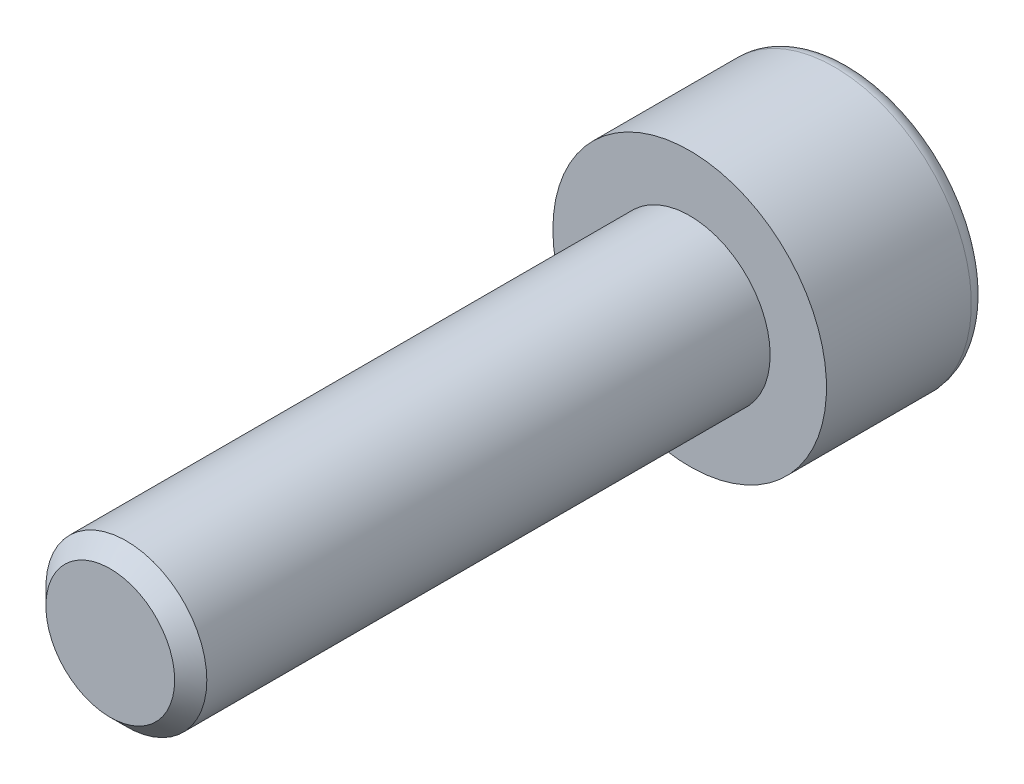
ISO-10303-21;
HEADER;
FILE_DESCRIPTION(('STEP AP214'),'2;1');
FILE_NAME('part.step','',(''),(''),'','','');
FILE_SCHEMA(('AUTOMOTIVE_DESIGN { 1 0 10303 214 1 1 1 1 }'));
ENDSEC;
DATA;
#1=APPLICATION_CONTEXT('core data for automotive mechanical design processes');
#2=APPLICATION_PROTOCOL_DEFINITION('international standard','automotive_design',2000,#1);
#3=PRODUCT_CONTEXT('',#1,'mechanical');
#4=PRODUCT('Part','Part','',(#3));
#5=PRODUCT_RELATED_PRODUCT_CATEGORY('part','',(#4));
#6=PRODUCT_DEFINITION_FORMATION('','',#4);
#7=PRODUCT_DEFINITION_CONTEXT('part definition',#1,'design');
#8=PRODUCT_DEFINITION('design','',#6,#7);
#9=PRODUCT_DEFINITION_SHAPE('','',#8);
#10=(LENGTH_UNIT() NAMED_UNIT(*) SI_UNIT(.MILLI.,.METRE.));
#11=(NAMED_UNIT(*) PLANE_ANGLE_UNIT() SI_UNIT($,.RADIAN.));
#12=(NAMED_UNIT(*) SI_UNIT($,.STERADIAN.) SOLID_ANGLE_UNIT());
#13=UNCERTAINTY_MEASURE_WITH_UNIT(LENGTH_MEASURE(1.E-05),#10,'distance_accuracy_value','');
#14=(GEOMETRIC_REPRESENTATION_CONTEXT(3) GLOBAL_UNCERTAINTY_ASSIGNED_CONTEXT((#13)) GLOBAL_UNIT_ASSIGNED_CONTEXT((#10,
#11,#12)) REPRESENTATION_CONTEXT('',''));
#15=CARTESIAN_POINT('',(0.,0.,0.));
#16=DIRECTION('',(0.,0.,1.));
#17=DIRECTION('',(1.,0.,0.));
#18=AXIS2_PLACEMENT_3D('',#15,#16,#17);
#19=CARTESIAN_POINT('',(0.,0.,-5.));
#20=DIRECTION('',(0.,0.,1.));
#21=DIRECTION('',(1.,0.,0.));
#22=AXIS2_PLACEMENT_3D('',#19,#20,#21);
#23=PLANE('',#22);
#24=CARTESIAN_POINT('',(0.,0.,-5.));
#25=DIRECTION('',(0.,0.,-1.));
#26=DIRECTION('',(-1.,0.,0.));
#27=AXIS2_PLACEMENT_3D('',#24,#25,#26);
#28=CIRCLE('',#27,3.75);
#29=CARTESIAN_POINT('',(-3.75,0.,-5.));
#30=VERTEX_POINT('',#29);
#31=EDGE_CURVE('E141',#30,#30,#28,.T.);
#32=ORIENTED_EDGE('',*,*,#31,.T.);
#33=EDGE_LOOP('',(#32));
#34=FACE_BOUND('',#33,.T.);
#35=DIRECTION('',(-0.86602540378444,0.499999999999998,0.));
#36=VECTOR('',#35,1.);
#37=CARTESIAN_POINT('',(0.,2.3094010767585,-5.));
#38=LINE('',#37,#36);
#39=CARTESIAN_POINT('',(2.,1.15470053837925,-5.));
#40=VERTEX_POINT('',#39);
#41=CARTESIAN_POINT('',(0.,2.3094010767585,-5.));
#42=VERTEX_POINT('',#41);
#43=EDGE_CURVE('E45',#40,#42,#38,.T.);
#44=ORIENTED_EDGE('',*,*,#43,.T.);
#45=DIRECTION('',(-0.866025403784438,-0.500000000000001,0.));
#46=VECTOR('',#45,1.);
#47=CARTESIAN_POINT('',(0.,2.3094010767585,-5.));
#48=LINE('',#47,#46);
#49=CARTESIAN_POINT('',(-2.,1.15470053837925,-5.));
#50=VERTEX_POINT('',#49);
#51=EDGE_CURVE('E85',#42,#50,#48,.T.);
#52=ORIENTED_EDGE('',*,*,#51,.T.);
#53=DIRECTION('',(0.,-1.,0.));
#54=VECTOR('',#53,1.);
#55=CARTESIAN_POINT('',(-2.,-1.15470053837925,-5.));
#56=LINE('',#55,#54);
#57=CARTESIAN_POINT('',(-2.,-1.15470053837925,-5.));
#58=VERTEX_POINT('',#57);
#59=EDGE_CURVE('E93',#50,#58,#56,.T.);
#60=ORIENTED_EDGE('',*,*,#59,.T.);
#61=DIRECTION('',(0.866025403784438,-0.500000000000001,0.));
#62=VECTOR('',#61,1.);
#63=CARTESIAN_POINT('',(0.,-2.3094010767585,-5.));
#64=LINE('',#63,#62);
#65=CARTESIAN_POINT('',(0.,-2.3094010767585,-5.));
#66=VERTEX_POINT('',#65);
#67=EDGE_CURVE('E111',#58,#66,#64,.T.);
#68=ORIENTED_EDGE('',*,*,#67,.T.);
#69=DIRECTION('',(0.86602540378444,0.499999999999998,0.));
#70=VECTOR('',#69,1.);
#71=CARTESIAN_POINT('',(0.,-2.3094010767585,-5.));
#72=LINE('',#71,#70);
#73=CARTESIAN_POINT('',(2.,-1.15470053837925,-5.));
#74=VERTEX_POINT('',#73);
#75=EDGE_CURVE('E114',#66,#74,#72,.T.);
#76=ORIENTED_EDGE('',*,*,#75,.T.);
#77=DIRECTION('',(0.,1.,0.));
#78=VECTOR('',#77,1.);
#79=CARTESIAN_POINT('',(2.,-1.15470053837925,-5.));
#80=LINE('',#79,#78);
#81=EDGE_CURVE('E104',#74,#40,#80,.T.);
#82=ORIENTED_EDGE('',*,*,#81,.T.);
#83=EDGE_LOOP('',(#44,#52,#60,#68,#76,#82));
#84=FACE_BOUND('',#83,.T.);
#85=ADVANCED_FACE('F31',(#34,#84),#23,.F.);
#86=CARTESIAN_POINT('',(0.,0.,-4.5));
#87=DIRECTION('',(0.,0.,-1.));
#88=DIRECTION('',(-1.,0.,0.));
#89=AXIS2_PLACEMENT_3D('',#86,#87,#88);
#90=TOROIDAL_SURFACE('',#89,3.75,0.5);
#91=ORIENTED_EDGE('',*,*,#31,.F.);
#92=EDGE_LOOP('',(#91));
#93=FACE_BOUND('',#92,.T.);
#94=CARTESIAN_POINT('',(0.,0.,-4.5));
#95=DIRECTION('',(0.,0.,-1.));
#96=DIRECTION('',(-1.,0.,0.));
#97=AXIS2_PLACEMENT_3D('',#94,#95,#96);
#98=CIRCLE('',#97,4.25);
#99=CARTESIAN_POINT('',(-4.25,0.,-4.5));
#100=VERTEX_POINT('',#99);
#101=EDGE_CURVE('E138',#100,#100,#98,.T.);
#102=ORIENTED_EDGE('',*,*,#101,.T.);
#103=EDGE_LOOP('',(#102));
#104=FACE_BOUND('',#103,.T.);
#105=ADVANCED_FACE('F160',(#93,#104),#90,.T.);
#106=CARTESIAN_POINT('',(0.,0.,0.));
#107=DIRECTION('',(0.,0.,-1.));
#108=DIRECTION('',(-1.,0.,0.));
#109=AXIS2_PLACEMENT_3D('',#106,#107,#108);
#110=CYLINDRICAL_SURFACE('',#109,4.25);
#111=ORIENTED_EDGE('',*,*,#101,.F.);
#112=EDGE_LOOP('',(#111));
#113=FACE_BOUND('',#112,.T.);
#114=CARTESIAN_POINT('',(0.,0.,0.));
#115=DIRECTION('',(0.,0.,-1.));
#116=DIRECTION('',(-1.,0.,0.));
#117=AXIS2_PLACEMENT_3D('',#114,#115,#116);
#118=CIRCLE('',#117,4.25);
#119=CARTESIAN_POINT('',(-4.25,0.,0.));
#120=VERTEX_POINT('',#119);
#121=EDGE_CURVE('E99',#120,#120,#118,.T.);
#122=ORIENTED_EDGE('',*,*,#121,.T.);
#123=EDGE_LOOP('',(#122));
#124=FACE_BOUND('',#123,.T.);
#125=ADVANCED_FACE('F165',(#113,#124),#110,.T.);
#126=CARTESIAN_POINT('',(0.,0.,0.));
#127=DIRECTION('',(0.,0.,-1.));
#128=DIRECTION('',(-1.,0.,0.));
#129=AXIS2_PLACEMENT_3D('',#126,#127,#128);
#130=PLANE('',#129);
#131=CARTESIAN_POINT('',(0.,0.,0.));
#132=DIRECTION('',(0.,0.,1.));
#133=DIRECTION('',(1.,0.,0.));
#134=AXIS2_PLACEMENT_3D('',#131,#132,#133);
#135=CIRCLE('',#134,2.5);
#136=CARTESIAN_POINT('',(2.5,0.,0.));
#137=VERTEX_POINT('',#136);
#138=EDGE_CURVE('E105',#137,#137,#135,.T.);
#139=ORIENTED_EDGE('',*,*,#138,.F.);
#140=EDGE_LOOP('',(#139));
#141=FACE_BOUND('',#140,.T.);
#142=ORIENTED_EDGE('',*,*,#121,.F.);
#143=EDGE_LOOP('',(#142));
#144=FACE_BOUND('',#143,.T.);
#145=ADVANCED_FACE('F173',(#141,#144),#130,.F.);
#146=CARTESIAN_POINT('',(0.,2.3094010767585,-2.5));
#147=DIRECTION('',(-0.499999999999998,-0.86602540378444,0.));
#148=DIRECTION('',(0.86602540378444,-0.499999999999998,0.));
#149=AXIS2_PLACEMENT_3D('',#146,#147,#148);
#150=PLANE('',#149);
#151=ORIENTED_EDGE('',*,*,#43,.F.);
#152=DIRECTION('',(0.,0.,-1.));
#153=VECTOR('',#152,1.);
#154=CARTESIAN_POINT('',(2.,1.15470053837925,-2.5));
#155=LINE('',#154,#153);
#156=CARTESIAN_POINT('',(2.,1.15470053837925,-2.5));
#157=VERTEX_POINT('',#156);
#158=EDGE_CURVE('E127',#157,#40,#155,.T.);
#159=ORIENTED_EDGE('',*,*,#158,.F.);
#160=DIRECTION('',(-0.86602540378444,0.499999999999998,0.));
#161=VECTOR('',#160,1.);
#162=CARTESIAN_POINT('',(0.,2.3094010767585,-2.5));
#163=LINE('',#162,#161);
#164=CARTESIAN_POINT('',(0.,2.3094010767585,-2.5));
#165=VERTEX_POINT('',#164);
#166=EDGE_CURVE('E98',#157,#165,#163,.T.);
#167=ORIENTED_EDGE('',*,*,#166,.T.);
#168=DIRECTION('',(0.,0.,-1.));
#169=VECTOR('',#168,1.);
#170=CARTESIAN_POINT('',(0.,2.3094010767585,-2.5));
#171=LINE('',#170,#169);
#172=EDGE_CURVE('E87',#165,#42,#171,.T.);
#173=ORIENTED_EDGE('',*,*,#172,.T.);
#174=EDGE_LOOP('',(#151,#159,#167,#173));
#175=FACE_BOUND('',#174,.T.);
#176=ADVANCED_FACE('F96',(#175),#150,.T.);
#177=CARTESIAN_POINT('',(0.,2.3094010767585,-2.5));
#178=DIRECTION('',(0.500000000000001,-0.866025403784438,0.));
#179=DIRECTION('',(0.866025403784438,0.500000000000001,0.));
#180=AXIS2_PLACEMENT_3D('',#177,#178,#179);
#181=PLANE('',#180);
#182=ORIENTED_EDGE('',*,*,#51,.F.);
#183=ORIENTED_EDGE('',*,*,#172,.F.);
#184=DIRECTION('',(-0.866025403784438,-0.500000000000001,0.));
#185=VECTOR('',#184,1.);
#186=CARTESIAN_POINT('',(0.,2.3094010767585,-2.5));
#187=LINE('',#186,#185);
#188=CARTESIAN_POINT('',(-2.,1.15470053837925,-2.5));
#189=VERTEX_POINT('',#188);
#190=EDGE_CURVE('E118',#165,#189,#187,.T.);
#191=ORIENTED_EDGE('',*,*,#190,.T.);
#192=DIRECTION('',(0.,0.,-1.));
#193=VECTOR('',#192,1.);
#194=CARTESIAN_POINT('',(-2.,1.15470053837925,-2.5));
#195=LINE('',#194,#193);
#196=EDGE_CURVE('E89',#189,#50,#195,.T.);
#197=ORIENTED_EDGE('',*,*,#196,.T.);
#198=EDGE_LOOP('',(#182,#183,#191,#197));
#199=FACE_BOUND('',#198,.T.);
#200=ADVANCED_FACE('F86',(#199),#181,.T.);
#201=CARTESIAN_POINT('',(-2.,-1.15470053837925,-2.5));
#202=DIRECTION('',(1.,0.,0.));
#203=DIRECTION('',(0.,0.,-1.));
#204=AXIS2_PLACEMENT_3D('',#201,#202,#203);
#205=PLANE('',#204);
#206=ORIENTED_EDGE('',*,*,#59,.F.);
#207=ORIENTED_EDGE('',*,*,#196,.F.);
#208=DIRECTION('',(0.,-1.,0.));
#209=VECTOR('',#208,1.);
#210=CARTESIAN_POINT('',(-2.,-1.15470053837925,-2.5));
#211=LINE('',#210,#209);
#212=CARTESIAN_POINT('',(-2.,-1.15470053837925,-2.5));
#213=VERTEX_POINT('',#212);
#214=EDGE_CURVE('E120',#189,#213,#211,.T.);
#215=ORIENTED_EDGE('',*,*,#214,.T.);
#216=DIRECTION('',(0.,0.,-1.));
#217=VECTOR('',#216,1.);
#218=CARTESIAN_POINT('',(-2.,-1.15470053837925,-2.5));
#219=LINE('',#218,#217);
#220=EDGE_CURVE('E133',#213,#58,#219,.T.);
#221=ORIENTED_EDGE('',*,*,#220,.T.);
#222=EDGE_LOOP('',(#206,#207,#215,#221));
#223=FACE_BOUND('',#222,.T.);
#224=ADVANCED_FACE('F188',(#223),#205,.T.);
#225=CARTESIAN_POINT('',(0.,-2.3094010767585,-2.5));
#226=DIRECTION('',(0.500000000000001,0.866025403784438,0.));
#227=DIRECTION('',(-0.866025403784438,0.500000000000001,0.));
#228=AXIS2_PLACEMENT_3D('',#225,#226,#227);
#229=PLANE('',#228);
#230=ORIENTED_EDGE('',*,*,#67,.F.);
#231=ORIENTED_EDGE('',*,*,#220,.F.);
#232=DIRECTION('',(0.866025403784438,-0.500000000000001,0.));
#233=VECTOR('',#232,1.);
#234=CARTESIAN_POINT('',(0.,-2.3094010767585,-2.5));
#235=LINE('',#234,#233);
#236=CARTESIAN_POINT('',(0.,-2.3094010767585,-2.5));
#237=VERTEX_POINT('',#236);
#238=EDGE_CURVE('E122',#213,#237,#235,.T.);
#239=ORIENTED_EDGE('',*,*,#238,.T.);
#240=DIRECTION('',(0.,0.,-1.));
#241=VECTOR('',#240,1.);
#242=CARTESIAN_POINT('',(0.,-2.3094010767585,-2.5));
#243=LINE('',#242,#241);
#244=EDGE_CURVE('E131',#237,#66,#243,.T.);
#245=ORIENTED_EDGE('',*,*,#244,.T.);
#246=EDGE_LOOP('',(#230,#231,#239,#245));
#247=FACE_BOUND('',#246,.T.);
#248=ADVANCED_FACE('F191',(#247),#229,.T.);
#249=CARTESIAN_POINT('',(0.,-2.3094010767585,-2.5));
#250=DIRECTION('',(-0.499999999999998,0.86602540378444,0.));
#251=DIRECTION('',(-0.86602540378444,-0.499999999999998,0.));
#252=AXIS2_PLACEMENT_3D('',#249,#250,#251);
#253=PLANE('',#252);
#254=ORIENTED_EDGE('',*,*,#75,.F.);
#255=ORIENTED_EDGE('',*,*,#244,.F.);
#256=DIRECTION('',(0.86602540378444,0.499999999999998,0.));
#257=VECTOR('',#256,1.);
#258=CARTESIAN_POINT('',(0.,-2.3094010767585,-2.5));
#259=LINE('',#258,#257);
#260=CARTESIAN_POINT('',(2.,-1.15470053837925,-2.5));
#261=VERTEX_POINT('',#260);
#262=EDGE_CURVE('E124',#237,#261,#259,.T.);
#263=ORIENTED_EDGE('',*,*,#262,.T.);
#264=DIRECTION('',(0.,0.,-1.));
#265=VECTOR('',#264,1.);
#266=CARTESIAN_POINT('',(2.,-1.15470053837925,-2.5));
#267=LINE('',#266,#265);
#268=EDGE_CURVE('E129',#261,#74,#267,.T.);
#269=ORIENTED_EDGE('',*,*,#268,.T.);
#270=EDGE_LOOP('',(#254,#255,#263,#269));
#271=FACE_BOUND('',#270,.T.);
#272=ADVANCED_FACE('F195',(#271),#253,.T.);
#273=CARTESIAN_POINT('',(2.,-1.15470053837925,-2.5));
#274=DIRECTION('',(-1.,0.,0.));
#275=DIRECTION('',(0.,0.,1.));
#276=AXIS2_PLACEMENT_3D('',#273,#274,#275);
#277=PLANE('',#276);
#278=ORIENTED_EDGE('',*,*,#81,.F.);
#279=ORIENTED_EDGE('',*,*,#268,.F.);
#280=DIRECTION('',(0.,1.,0.));
#281=VECTOR('',#280,1.);
#282=CARTESIAN_POINT('',(2.,-1.15470053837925,-2.5));
#283=LINE('',#282,#281);
#284=EDGE_CURVE('E52',#261,#157,#283,.T.);
#285=ORIENTED_EDGE('',*,*,#284,.T.);
#286=ORIENTED_EDGE('',*,*,#158,.T.);
#287=EDGE_LOOP('',(#278,#279,#285,#286));
#288=FACE_BOUND('',#287,.T.);
#289=ADVANCED_FACE('F199',(#288),#277,.T.);
#290=CARTESIAN_POINT('',(2.,1.15470053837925,-2.5));
#291=DIRECTION('',(0.,0.,1.));
#292=DIRECTION('',(1.,0.,0.));
#293=AXIS2_PLACEMENT_3D('',#290,#291,#292);
#294=PLANE('',#293);
#295=ORIENTED_EDGE('',*,*,#166,.F.);
#296=ORIENTED_EDGE('',*,*,#284,.F.);
#297=ORIENTED_EDGE('',*,*,#262,.F.);
#298=ORIENTED_EDGE('',*,*,#238,.F.);
#299=ORIENTED_EDGE('',*,*,#214,.F.);
#300=ORIENTED_EDGE('',*,*,#190,.F.);
#301=EDGE_LOOP('',(#295,#296,#297,#298,#299,#300));
#302=FACE_BOUND('',#301,.T.);
#303=ADVANCED_FACE('F203',(#302),#294,.F.);
#304=CARTESIAN_POINT('',(0.,0.,18.));
#305=DIRECTION('',(0.,0.,1.));
#306=DIRECTION('',(1.,0.,0.));
#307=AXIS2_PLACEMENT_3D('',#304,#305,#306);
#308=PLANE('',#307);
#309=CARTESIAN_POINT('',(0.,0.,18.));
#310=DIRECTION('',(0.,0.,1.));
#311=DIRECTION('',(1.,0.,0.));
#312=AXIS2_PLACEMENT_3D('',#309,#310,#311);
#313=CIRCLE('',#312,2.);
#314=CARTESIAN_POINT('',(2.,0.,18.));
#315=VERTEX_POINT('',#314);
#316=EDGE_CURVE('E38',#315,#315,#313,.T.);
#317=ORIENTED_EDGE('',*,*,#316,.T.);
#318=EDGE_LOOP('',(#317));
#319=FACE_BOUND('',#318,.T.);
#320=ADVANCED_FACE('F146',(#319),#308,.T.);
#321=CARTESIAN_POINT('',(0.,0.,0.));
#322=DIRECTION('',(0.,0.,1.));
#323=DIRECTION('',(1.,0.,0.));
#324=AXIS2_PLACEMENT_3D('',#321,#322,#323);
#325=CYLINDRICAL_SURFACE('',#324,2.5);
#326=CARTESIAN_POINT('',(0.,0.,17.5));
#327=DIRECTION('',(0.,0.,1.));
#328=DIRECTION('',(1.,0.,0.));
#329=AXIS2_PLACEMENT_3D('',#326,#327,#328);
#330=CIRCLE('',#329,2.5);
#331=CARTESIAN_POINT('',(2.5,0.,17.5));
#332=VERTEX_POINT('',#331);
#333=EDGE_CURVE('E11',#332,#332,#330,.F.);
#334=ORIENTED_EDGE('',*,*,#333,.T.);
#335=EDGE_LOOP('',(#334));
#336=FACE_BOUND('',#335,.T.);
#337=ORIENTED_EDGE('',*,*,#138,.T.);
#338=EDGE_LOOP('',(#337));
#339=FACE_BOUND('',#338,.T.);
#340=ADVANCED_FACE('F150',(#336,#339),#325,.T.);
#341=CARTESIAN_POINT('',(0.,0.,18.));
#342=DIRECTION('',(0.,0.,-1.));
#343=DIRECTION('',(-1.,0.,0.));
#344=AXIS2_PLACEMENT_3D('',#341,#342,#343);
#345=CONICAL_SURFACE('',#344,2.,0.785398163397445);
#346=ORIENTED_EDGE('',*,*,#333,.F.);
#347=EDGE_LOOP('',(#346));
#348=FACE_BOUND('',#347,.T.);
#349=ORIENTED_EDGE('',*,*,#316,.F.);
#350=EDGE_LOOP('',(#349));
#351=FACE_BOUND('',#350,.T.);
#352=ADVANCED_FACE('F148',(#348,#351),#345,.T.);
#353=CLOSED_SHELL('',(#85,#105,#125,#145,#176,#200,#224,#248,#272,#289,#303,#320,#340,#352));
#354=MANIFOLD_SOLID_BREP('B2',#353);
#355=ADVANCED_BREP_SHAPE_REPRESENTATION('',(#18,#354),#14);
#356=SHAPE_DEFINITION_REPRESENTATION(#9,#355);
ENDSEC;
END-ISO-10303-21;
